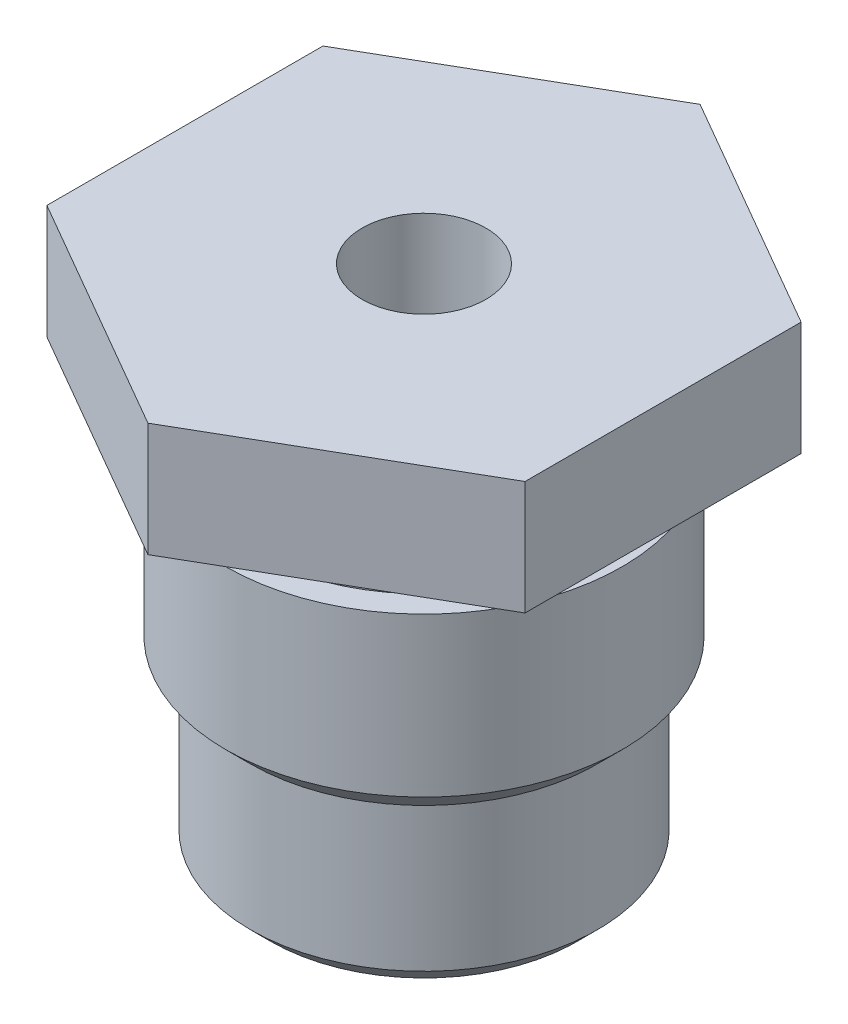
ISO-10303-21;
HEADER;
FILE_DESCRIPTION(('STEP AP214'),'2;1');
FILE_NAME('part.step','',(''),(''),'','','');
FILE_SCHEMA(('AUTOMOTIVE_DESIGN { 1 0 10303 214 1 1 1 1 }'));
ENDSEC;
DATA;
#1=APPLICATION_CONTEXT('core data for automotive mechanical design processes');
#2=APPLICATION_PROTOCOL_DEFINITION('international standard','automotive_design',2000,#1);
#3=PRODUCT_CONTEXT('',#1,'mechanical');
#4=PRODUCT('Part','Part','',(#3));
#5=PRODUCT_RELATED_PRODUCT_CATEGORY('part','',(#4));
#6=PRODUCT_DEFINITION_FORMATION('','',#4);
#7=PRODUCT_DEFINITION_CONTEXT('part definition',#1,'design');
#8=PRODUCT_DEFINITION('design','',#6,#7);
#9=PRODUCT_DEFINITION_SHAPE('','',#8);
#10=(LENGTH_UNIT() NAMED_UNIT(*) SI_UNIT(.MILLI.,.METRE.));
#11=(NAMED_UNIT(*) PLANE_ANGLE_UNIT() SI_UNIT($,.RADIAN.));
#12=(NAMED_UNIT(*) SI_UNIT($,.STERADIAN.) SOLID_ANGLE_UNIT());
#13=UNCERTAINTY_MEASURE_WITH_UNIT(LENGTH_MEASURE(1.E-05),#10,'distance_accuracy_value','');
#14=(GEOMETRIC_REPRESENTATION_CONTEXT(3) GLOBAL_UNCERTAINTY_ASSIGNED_CONTEXT((#13)) GLOBAL_UNIT_ASSIGNED_CONTEXT((#10,
#11,#12)) REPRESENTATION_CONTEXT('',''));
#15=CARTESIAN_POINT('',(0.,0.,0.));
#16=DIRECTION('',(0.,0.,1.));
#17=DIRECTION('',(1.,0.,0.));
#18=AXIS2_PLACEMENT_3D('',#15,#16,#17);
#19=CARTESIAN_POINT('',(0.,0.400000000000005,0.));
#20=DIRECTION('',(0.,1.,0.));
#21=DIRECTION('',(0.,0.,1.));
#22=AXIS2_PLACEMENT_3D('',#19,#20,#21);
#23=CONICAL_SURFACE('',#22,3.49999999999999,0.785398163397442);
#24=CARTESIAN_POINT('',(0.,0.,0.));
#25=DIRECTION('',(0.,1.,0.));
#26=DIRECTION('',(0.,0.,1.));
#27=AXIS2_PLACEMENT_3D('',#24,#25,#26);
#28=CIRCLE('',#27,3.09999999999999);
#29=CARTESIAN_POINT('',(0.,0.,3.09999999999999));
#30=VERTEX_POINT('',#29);
#31=EDGE_CURVE('E11',#30,#30,#28,.T.);
#32=ORIENTED_EDGE('',*,*,#31,.T.);
#33=EDGE_LOOP('',(#32));
#34=FACE_BOUND('',#33,.T.);
#35=CARTESIAN_POINT('',(0.,0.400000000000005,0.));
#36=DIRECTION('',(0.,1.,0.));
#37=DIRECTION('',(0.,0.,1.));
#38=AXIS2_PLACEMENT_3D('',#35,#36,#37);
#39=CIRCLE('',#38,3.49999999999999);
#40=CARTESIAN_POINT('',(0.,0.400000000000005,3.49999999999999));
#41=VERTEX_POINT('',#40);
#42=EDGE_CURVE('E99',#41,#41,#39,.T.);
#43=ORIENTED_EDGE('',*,*,#42,.F.);
#44=EDGE_LOOP('',(#43));
#45=FACE_BOUND('',#44,.T.);
#46=ADVANCED_FACE('F29',(#34,#45),#23,.T.);
#47=CARTESIAN_POINT('',(-2.59999999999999,0.,0.));
#48=DIRECTION('',(0.,-1.,0.));
#49=DIRECTION('',(0.,0.,-1.));
#50=AXIS2_PLACEMENT_3D('',#47,#48,#49);
#51=PLANE('',#50);
#52=CARTESIAN_POINT('',(0.,0.,0.));
#53=DIRECTION('',(0.,1.,0.));
#54=DIRECTION('',(0.,0.,1.));
#55=AXIS2_PLACEMENT_3D('',#52,#53,#54);
#56=CIRCLE('',#55,2.59999999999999);
#57=CARTESIAN_POINT('',(0.,0.,2.59999999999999));
#58=VERTEX_POINT('',#57);
#59=EDGE_CURVE('E36',#58,#58,#56,.T.);
#60=ORIENTED_EDGE('',*,*,#59,.T.);
#61=EDGE_LOOP('',(#60));
#62=FACE_BOUND('',#61,.T.);
#63=ORIENTED_EDGE('',*,*,#31,.F.);
#64=EDGE_LOOP('',(#63));
#65=FACE_BOUND('',#64,.T.);
#66=ADVANCED_FACE('F162',(#62,#65),#51,.T.);
#67=CARTESIAN_POINT('',(0.,60.,0.));
#68=DIRECTION('',(0.,1.,0.));
#69=DIRECTION('',(0.,0.,1.));
#70=AXIS2_PLACEMENT_3D('',#67,#68,#69);
#71=CYLINDRICAL_SURFACE('',#70,2.59999999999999);
#72=CARTESIAN_POINT('',(0.,5.73,0.));
#73=DIRECTION('',(0.,1.,0.));
#74=DIRECTION('',(0.,0.,1.));
#75=AXIS2_PLACEMENT_3D('',#72,#73,#74);
#76=CIRCLE('',#75,2.59999999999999);
#77=CARTESIAN_POINT('',(0.,5.73,2.59999999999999));
#78=VERTEX_POINT('',#77);
#79=EDGE_CURVE('E157',#78,#78,#76,.T.);
#80=ORIENTED_EDGE('',*,*,#79,.T.);
#81=EDGE_LOOP('',(#80));
#82=FACE_BOUND('',#81,.T.);
#83=ORIENTED_EDGE('',*,*,#59,.F.);
#84=EDGE_LOOP('',(#83));
#85=FACE_BOUND('',#84,.T.);
#86=ADVANCED_FACE('F165',(#82,#85),#71,.F.);
#87=CARTESIAN_POINT('',(0.,5.73,0.));
#88=DIRECTION('',(0.,-1.,0.));
#89=DIRECTION('',(0.,0.,-1.));
#90=AXIS2_PLACEMENT_3D('',#87,#88,#89);
#91=CONICAL_SURFACE('',#90,2.59999999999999,1.0524482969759);
#92=CARTESIAN_POINT('',(0.,6.5,0.));
#93=DIRECTION('',(0.,1.,0.));
#94=DIRECTION('',(0.,0.,1.));
#95=AXIS2_PLACEMENT_3D('',#92,#93,#94);
#96=CIRCLE('',#95,1.24999999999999);
#97=CARTESIAN_POINT('',(0.,6.5,1.24999999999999));
#98=VERTEX_POINT('',#97);
#99=EDGE_CURVE('E154',#98,#98,#96,.T.);
#100=ORIENTED_EDGE('',*,*,#99,.T.);
#101=EDGE_LOOP('',(#100));
#102=FACE_BOUND('',#101,.T.);
#103=ORIENTED_EDGE('',*,*,#79,.F.);
#104=EDGE_LOOP('',(#103));
#105=FACE_BOUND('',#104,.T.);
#106=ADVANCED_FACE('F167',(#102,#105),#91,.F.);
#107=CARTESIAN_POINT('',(0.,60.,0.));
#108=DIRECTION('',(0.,1.,0.));
#109=DIRECTION('',(0.,0.,1.));
#110=AXIS2_PLACEMENT_3D('',#107,#108,#109);
#111=CYLINDRICAL_SURFACE('',#110,1.24999999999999);
#112=ORIENTED_EDGE('',*,*,#99,.F.);
#113=EDGE_LOOP('',(#112));
#114=FACE_BOUND('',#113,.T.);
#115=CARTESIAN_POINT('',(0.,10.3,0.));
#116=DIRECTION('',(0.,1.,0.));
#117=DIRECTION('',(0.,0.,1.));
#118=AXIS2_PLACEMENT_3D('',#115,#116,#117);
#119=CIRCLE('',#118,1.25);
#120=CARTESIAN_POINT('',(0.,10.3,1.25));
#121=VERTEX_POINT('',#120);
#122=EDGE_CURVE('E105',#121,#121,#119,.T.);
#123=ORIENTED_EDGE('',*,*,#122,.T.);
#124=EDGE_LOOP('',(#123));
#125=FACE_BOUND('',#124,.T.);
#126=ADVANCED_FACE('F174',(#114,#125),#111,.F.);
#127=CARTESIAN_POINT('',(0.,60.,0.));
#128=DIRECTION('',(0.,1.,0.));
#129=DIRECTION('',(0.,0.,1.));
#130=AXIS2_PLACEMENT_3D('',#127,#128,#129);
#131=CYLINDRICAL_SURFACE('',#130,3.5);
#132=CARTESIAN_POINT('',(0.,7.00000000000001,0.));
#133=DIRECTION('',(0.,1.,0.));
#134=DIRECTION('',(0.,0.,1.));
#135=AXIS2_PLACEMENT_3D('',#132,#133,#134);
#136=CIRCLE('',#135,3.5);
#137=CARTESIAN_POINT('',(0.,7.00000000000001,3.5));
#138=VERTEX_POINT('',#137);
#139=EDGE_CURVE('E148',#138,#138,#136,.T.);
#140=ORIENTED_EDGE('',*,*,#139,.T.);
#141=EDGE_LOOP('',(#140));
#142=FACE_BOUND('',#141,.T.);
#143=CARTESIAN_POINT('',(0.,7.99999999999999,0.));
#144=DIRECTION('',(0.,1.,0.));
#145=DIRECTION('',(0.,0.,1.));
#146=AXIS2_PLACEMENT_3D('',#143,#144,#145);
#147=CIRCLE('',#146,3.49999999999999);
#148=CARTESIAN_POINT('',(0.,7.99999999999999,3.49999999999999));
#149=VERTEX_POINT('',#148);
#150=EDGE_CURVE('E151',#149,#149,#147,.T.);
#151=ORIENTED_EDGE('',*,*,#150,.F.);
#152=EDGE_LOOP('',(#151));
#153=FACE_BOUND('',#152,.T.);
#154=ADVANCED_FACE('F207',(#142,#153),#131,.T.);
#155=CARTESIAN_POINT('',(-3.99999999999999,7.00000000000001,0.));
#156=DIRECTION('',(0.,1.,0.));
#157=DIRECTION('',(0.,0.,1.));
#158=AXIS2_PLACEMENT_3D('',#155,#156,#157);
#159=PLANE('',#158);
#160=CARTESIAN_POINT('',(0.,7.00000000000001,0.));
#161=DIRECTION('',(0.,1.,0.));
#162=DIRECTION('',(0.,0.,1.));
#163=AXIS2_PLACEMENT_3D('',#160,#161,#162);
#164=CIRCLE('',#163,3.99999999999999);
#165=CARTESIAN_POINT('',(0.,7.00000000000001,3.99999999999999));
#166=VERTEX_POINT('',#165);
#167=EDGE_CURVE('E145',#166,#166,#164,.T.);
#168=ORIENTED_EDGE('',*,*,#167,.T.);
#169=EDGE_LOOP('',(#168));
#170=FACE_BOUND('',#169,.T.);
#171=ORIENTED_EDGE('',*,*,#139,.F.);
#172=EDGE_LOOP('',(#171));
#173=FACE_BOUND('',#172,.T.);
#174=ADVANCED_FACE('F201',(#170,#173),#159,.T.);
#175=CARTESIAN_POINT('',(0.,60.,0.));
#176=DIRECTION('',(0.,1.,0.));
#177=DIRECTION('',(0.,0.,1.));
#178=AXIS2_PLACEMENT_3D('',#175,#176,#177);
#179=CYLINDRICAL_SURFACE('',#178,3.99999999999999);
#180=CARTESIAN_POINT('',(0.,3.8,0.));
#181=DIRECTION('',(0.,1.,0.));
#182=DIRECTION('',(0.,0.,1.));
#183=AXIS2_PLACEMENT_3D('',#180,#181,#182);
#184=CIRCLE('',#183,4.);
#185=CARTESIAN_POINT('',(0.,3.8,4.));
#186=VERTEX_POINT('',#185);
#187=EDGE_CURVE('E142',#186,#186,#184,.T.);
#188=ORIENTED_EDGE('',*,*,#187,.T.);
#189=EDGE_LOOP('',(#188));
#190=FACE_BOUND('',#189,.T.);
#191=ORIENTED_EDGE('',*,*,#167,.F.);
#192=EDGE_LOOP('',(#191));
#193=FACE_BOUND('',#192,.T.);
#194=ADVANCED_FACE('F195',(#190,#193),#179,.T.);
#195=CARTESIAN_POINT('',(0.,3.8,0.));
#196=DIRECTION('',(0.,1.,0.));
#197=DIRECTION('',(0.,0.,1.));
#198=AXIS2_PLACEMENT_3D('',#195,#196,#197);
#199=CONICAL_SURFACE('',#198,4.,0.785398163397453);
#200=CARTESIAN_POINT('',(0.,3.3,0.));
#201=DIRECTION('',(0.,1.,0.));
#202=DIRECTION('',(0.,0.,1.));
#203=AXIS2_PLACEMENT_3D('',#200,#201,#202);
#204=CIRCLE('',#203,3.49999999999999);
#205=CARTESIAN_POINT('',(0.,3.3,3.49999999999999));
#206=VERTEX_POINT('',#205);
#207=EDGE_CURVE('E139',#206,#206,#204,.T.);
#208=ORIENTED_EDGE('',*,*,#207,.T.);
#209=EDGE_LOOP('',(#208));
#210=FACE_BOUND('',#209,.T.);
#211=ORIENTED_EDGE('',*,*,#187,.F.);
#212=EDGE_LOOP('',(#211));
#213=FACE_BOUND('',#212,.T.);
#214=ADVANCED_FACE('F189',(#210,#213),#199,.T.);
#215=CARTESIAN_POINT('',(0.,60.,0.));
#216=DIRECTION('',(0.,1.,0.));
#217=DIRECTION('',(0.,0.,1.));
#218=AXIS2_PLACEMENT_3D('',#215,#216,#217);
#219=CYLINDRICAL_SURFACE('',#218,3.49999999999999);
#220=ORIENTED_EDGE('',*,*,#42,.T.);
#221=EDGE_LOOP('',(#220));
#222=FACE_BOUND('',#221,.T.);
#223=ORIENTED_EDGE('',*,*,#207,.F.);
#224=EDGE_LOOP('',(#223));
#225=FACE_BOUND('',#224,.T.);
#226=ADVANCED_FACE('F185',(#222,#225),#219,.T.);
#227=CARTESIAN_POINT('',(0.,10.3,5.575));
#228=DIRECTION('',(0.,1.,0.));
#229=DIRECTION('',(0.,0.,1.));
#230=AXIS2_PLACEMENT_3D('',#227,#228,#229);
#231=PLANE('',#230);
#232=DIRECTION('',(0.866025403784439,0.,0.5));
#233=VECTOR('',#232,1.);
#234=CARTESIAN_POINT('',(-4.82809162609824,10.3,2.7875));
#235=LINE('',#234,#233);
#236=CARTESIAN_POINT('',(-4.82809162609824,10.3,2.7875));
#237=VERTEX_POINT('',#236);
#238=CARTESIAN_POINT('',(0.,10.3,5.575));
#239=VERTEX_POINT('',#238);
#240=EDGE_CURVE('E117',#237,#239,#235,.T.);
#241=ORIENTED_EDGE('',*,*,#240,.T.);
#242=DIRECTION('',(0.866025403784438,0.,-0.5));
#243=VECTOR('',#242,1.);
#244=CARTESIAN_POINT('',(0.,10.3,5.575));
#245=LINE('',#244,#243);
#246=CARTESIAN_POINT('',(4.82809162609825,10.3,2.7875));
#247=VERTEX_POINT('',#246);
#248=EDGE_CURVE('E96',#239,#247,#245,.T.);
#249=ORIENTED_EDGE('',*,*,#248,.T.);
#250=DIRECTION('',(0.,0.,-1.));
#251=VECTOR('',#250,1.);
#252=CARTESIAN_POINT('',(4.82809162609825,10.3,2.7875));
#253=LINE('',#252,#251);
#254=CARTESIAN_POINT('',(4.82809162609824,10.3,-2.7875));
#255=VERTEX_POINT('',#254);
#256=EDGE_CURVE('E120',#247,#255,#253,.T.);
#257=ORIENTED_EDGE('',*,*,#256,.T.);
#258=DIRECTION('',(-0.866025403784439,0.,-0.5));
#259=VECTOR('',#258,1.);
#260=CARTESIAN_POINT('',(4.82809162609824,10.3,-2.7875));
#261=LINE('',#260,#259);
#262=CARTESIAN_POINT('',(0.,10.3,-5.575));
#263=VERTEX_POINT('',#262);
#264=EDGE_CURVE('E122',#255,#263,#261,.T.);
#265=ORIENTED_EDGE('',*,*,#264,.T.);
#266=DIRECTION('',(-0.866025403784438,0.,0.5));
#267=VECTOR('',#266,1.);
#268=CARTESIAN_POINT('',(0.,10.3,-5.575));
#269=LINE('',#268,#267);
#270=CARTESIAN_POINT('',(-4.82809162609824,10.3,-2.7875));
#271=VERTEX_POINT('',#270);
#272=EDGE_CURVE('E48',#263,#271,#269,.T.);
#273=ORIENTED_EDGE('',*,*,#272,.T.);
#274=DIRECTION('',(0.,0.,1.));
#275=VECTOR('',#274,1.);
#276=CARTESIAN_POINT('',(-4.82809162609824,10.3,-2.7875));
#277=LINE('',#276,#275);
#278=EDGE_CURVE('E43',#271,#237,#277,.T.);
#279=ORIENTED_EDGE('',*,*,#278,.T.);
#280=EDGE_LOOP('',(#241,#249,#257,#265,#273,#279));
#281=FACE_BOUND('',#280,.T.);
#282=ORIENTED_EDGE('',*,*,#122,.F.);
#283=EDGE_LOOP('',(#282));
#284=FACE_BOUND('',#283,.T.);
#285=ADVANCED_FACE('F188',(#281,#284),#231,.T.);
#286=CARTESIAN_POINT('',(0.,7.99999999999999,5.575));
#287=DIRECTION('',(0.,1.,0.));
#288=DIRECTION('',(0.,0.,1.));
#289=AXIS2_PLACEMENT_3D('',#286,#287,#288);
#290=PLANE('',#289);
#291=ORIENTED_EDGE('',*,*,#150,.T.);
#292=EDGE_LOOP('',(#291));
#293=FACE_BOUND('',#292,.T.);
#294=DIRECTION('',(0.866025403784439,0.,0.5));
#295=VECTOR('',#294,1.);
#296=CARTESIAN_POINT('',(-4.82809162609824,7.99999999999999,2.7875));
#297=LINE('',#296,#295);
#298=CARTESIAN_POINT('',(-4.82809162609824,7.99999999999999,2.7875));
#299=VERTEX_POINT('',#298);
#300=CARTESIAN_POINT('',(0.,7.99999999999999,5.575));
#301=VERTEX_POINT('',#300);
#302=EDGE_CURVE('E86',#299,#301,#297,.T.);
#303=ORIENTED_EDGE('',*,*,#302,.F.);
#304=DIRECTION('',(0.,0.,1.));
#305=VECTOR('',#304,1.);
#306=CARTESIAN_POINT('',(-4.82809162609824,7.99999999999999,-2.7875));
#307=LINE('',#306,#305);
#308=CARTESIAN_POINT('',(-4.82809162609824,7.99999999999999,-2.7875));
#309=VERTEX_POINT('',#308);
#310=EDGE_CURVE('E115',#309,#299,#307,.T.);
#311=ORIENTED_EDGE('',*,*,#310,.F.);
#312=DIRECTION('',(-0.866025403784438,0.,0.5));
#313=VECTOR('',#312,1.);
#314=CARTESIAN_POINT('',(0.,7.99999999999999,-5.575));
#315=LINE('',#314,#313);
#316=CARTESIAN_POINT('',(0.,7.99999999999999,-5.575));
#317=VERTEX_POINT('',#316);
#318=EDGE_CURVE('E113',#317,#309,#315,.T.);
#319=ORIENTED_EDGE('',*,*,#318,.F.);
#320=DIRECTION('',(-0.866025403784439,0.,-0.5));
#321=VECTOR('',#320,1.);
#322=CARTESIAN_POINT('',(4.82809162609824,7.99999999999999,-2.7875));
#323=LINE('',#322,#321);
#324=CARTESIAN_POINT('',(4.82809162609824,7.99999999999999,-2.7875));
#325=VERTEX_POINT('',#324);
#326=EDGE_CURVE('E111',#325,#317,#323,.T.);
#327=ORIENTED_EDGE('',*,*,#326,.F.);
#328=DIRECTION('',(0.,0.,-1.));
#329=VECTOR('',#328,1.);
#330=CARTESIAN_POINT('',(4.82809162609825,7.99999999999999,2.7875));
#331=LINE('',#330,#329);
#332=CARTESIAN_POINT('',(4.82809162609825,7.99999999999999,2.7875));
#333=VERTEX_POINT('',#332);
#334=EDGE_CURVE('E88',#333,#325,#331,.T.);
#335=ORIENTED_EDGE('',*,*,#334,.F.);
#336=DIRECTION('',(0.866025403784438,0.,-0.5));
#337=VECTOR('',#336,1.);
#338=CARTESIAN_POINT('',(0.,7.99999999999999,5.575));
#339=LINE('',#338,#337);
#340=EDGE_CURVE('E81',#301,#333,#339,.T.);
#341=ORIENTED_EDGE('',*,*,#340,.F.);
#342=EDGE_LOOP('',(#303,#311,#319,#327,#335,#341));
#343=FACE_BOUND('',#342,.T.);
#344=ADVANCED_FACE('F83',(#293,#343),#290,.F.);
#345=CARTESIAN_POINT('',(-4.82809162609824,10.3,2.7875));
#346=DIRECTION('',(0.5,0.,-0.866025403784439));
#347=DIRECTION('',(-0.866025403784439,0.,-0.5));
#348=AXIS2_PLACEMENT_3D('',#345,#346,#347);
#349=PLANE('',#348);
#350=ORIENTED_EDGE('',*,*,#302,.T.);
#351=DIRECTION('',(0.,-1.,0.));
#352=VECTOR('',#351,1.);
#353=CARTESIAN_POINT('',(0.,10.3,5.575));
#354=LINE('',#353,#352);
#355=EDGE_CURVE('E94',#239,#301,#354,.T.);
#356=ORIENTED_EDGE('',*,*,#355,.F.);
#357=ORIENTED_EDGE('',*,*,#240,.F.);
#358=DIRECTION('',(0.,-1.,0.));
#359=VECTOR('',#358,1.);
#360=CARTESIAN_POINT('',(-4.82809162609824,10.3,2.7875));
#361=LINE('',#360,#359);
#362=EDGE_CURVE('E104',#237,#299,#361,.T.);
#363=ORIENTED_EDGE('',*,*,#362,.T.);
#364=EDGE_LOOP('',(#350,#356,#357,#363));
#365=FACE_BOUND('',#364,.T.);
#366=ADVANCED_FACE('F103',(#365),#349,.F.);
#367=CARTESIAN_POINT('',(0.,10.3,5.575));
#368=DIRECTION('',(-0.5,0.,-0.866025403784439));
#369=DIRECTION('',(-0.866025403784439,0.,0.5));
#370=AXIS2_PLACEMENT_3D('',#367,#368,#369);
#371=PLANE('',#370);
#372=ORIENTED_EDGE('',*,*,#340,.T.);
#373=DIRECTION('',(0.,-1.,0.));
#374=VECTOR('',#373,1.);
#375=CARTESIAN_POINT('',(4.82809162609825,10.3,2.7875));
#376=LINE('',#375,#374);
#377=EDGE_CURVE('E100',#247,#333,#376,.T.);
#378=ORIENTED_EDGE('',*,*,#377,.F.);
#379=ORIENTED_EDGE('',*,*,#248,.F.);
#380=ORIENTED_EDGE('',*,*,#355,.T.);
#381=EDGE_LOOP('',(#372,#378,#379,#380));
#382=FACE_BOUND('',#381,.T.);
#383=ADVANCED_FACE('F95',(#382),#371,.F.);
#384=CARTESIAN_POINT('',(4.82809162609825,10.3,2.7875));
#385=DIRECTION('',(-1.,0.,0.));
#386=DIRECTION('',(0.,0.,1.));
#387=AXIS2_PLACEMENT_3D('',#384,#385,#386);
#388=PLANE('',#387);
#389=ORIENTED_EDGE('',*,*,#334,.T.);
#390=DIRECTION('',(0.,-1.,0.));
#391=VECTOR('',#390,1.);
#392=CARTESIAN_POINT('',(4.82809162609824,10.3,-2.7875));
#393=LINE('',#392,#391);
#394=EDGE_CURVE('E133',#255,#325,#393,.T.);
#395=ORIENTED_EDGE('',*,*,#394,.F.);
#396=ORIENTED_EDGE('',*,*,#256,.F.);
#397=ORIENTED_EDGE('',*,*,#377,.T.);
#398=EDGE_LOOP('',(#389,#395,#396,#397));
#399=FACE_BOUND('',#398,.T.);
#400=ADVANCED_FACE('F236',(#399),#388,.F.);
#401=CARTESIAN_POINT('',(4.82809162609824,10.3,-2.7875));
#402=DIRECTION('',(-0.5,0.,0.866025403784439));
#403=DIRECTION('',(0.866025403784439,0.,0.5));
#404=AXIS2_PLACEMENT_3D('',#401,#402,#403);
#405=PLANE('',#404);
#406=ORIENTED_EDGE('',*,*,#326,.T.);
#407=DIRECTION('',(0.,-1.,0.));
#408=VECTOR('',#407,1.);
#409=CARTESIAN_POINT('',(0.,10.3,-5.575));
#410=LINE('',#409,#408);
#411=EDGE_CURVE('E130',#263,#317,#410,.T.);
#412=ORIENTED_EDGE('',*,*,#411,.F.);
#413=ORIENTED_EDGE('',*,*,#264,.F.);
#414=ORIENTED_EDGE('',*,*,#394,.T.);
#415=EDGE_LOOP('',(#406,#412,#413,#414));
#416=FACE_BOUND('',#415,.T.);
#417=ADVANCED_FACE('F232',(#416),#405,.F.);
#418=CARTESIAN_POINT('',(0.,10.3,-5.575));
#419=DIRECTION('',(0.5,0.,0.866025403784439));
#420=DIRECTION('',(0.866025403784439,0.,-0.5));
#421=AXIS2_PLACEMENT_3D('',#418,#419,#420);
#422=PLANE('',#421);
#423=ORIENTED_EDGE('',*,*,#318,.T.);
#424=DIRECTION('',(0.,-1.,0.));
#425=VECTOR('',#424,1.);
#426=CARTESIAN_POINT('',(-4.82809162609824,10.3,-2.7875));
#427=LINE('',#426,#425);
#428=EDGE_CURVE('E127',#271,#309,#427,.T.);
#429=ORIENTED_EDGE('',*,*,#428,.F.);
#430=ORIENTED_EDGE('',*,*,#272,.F.);
#431=ORIENTED_EDGE('',*,*,#411,.T.);
#432=EDGE_LOOP('',(#423,#429,#430,#431));
#433=FACE_BOUND('',#432,.T.);
#434=ADVANCED_FACE('F228',(#433),#422,.F.);
#435=CARTESIAN_POINT('',(-4.82809162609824,10.3,-2.7875));
#436=DIRECTION('',(1.,0.,0.));
#437=DIRECTION('',(0.,0.,-1.));
#438=AXIS2_PLACEMENT_3D('',#435,#436,#437);
#439=PLANE('',#438);
#440=ORIENTED_EDGE('',*,*,#310,.T.);
#441=ORIENTED_EDGE('',*,*,#362,.F.);
#442=ORIENTED_EDGE('',*,*,#278,.F.);
#443=ORIENTED_EDGE('',*,*,#428,.T.);
#444=EDGE_LOOP('',(#440,#441,#442,#443));
#445=FACE_BOUND('',#444,.T.);
#446=ADVANCED_FACE('F225',(#445),#439,.F.);
#447=CLOSED_SHELL('',(#46,#66,#86,#106,#126,#154,#174,#194,#214,#226,#285,#344,#366,#383,#400,
#417,#434,#446));
#448=MANIFOLD_SOLID_BREP('B2',#447);
#449=ADVANCED_BREP_SHAPE_REPRESENTATION('',(#18,#448),#14);
#450=SHAPE_DEFINITION_REPRESENTATION(#9,#449);
ENDSEC;
END-ISO-10303-21;
